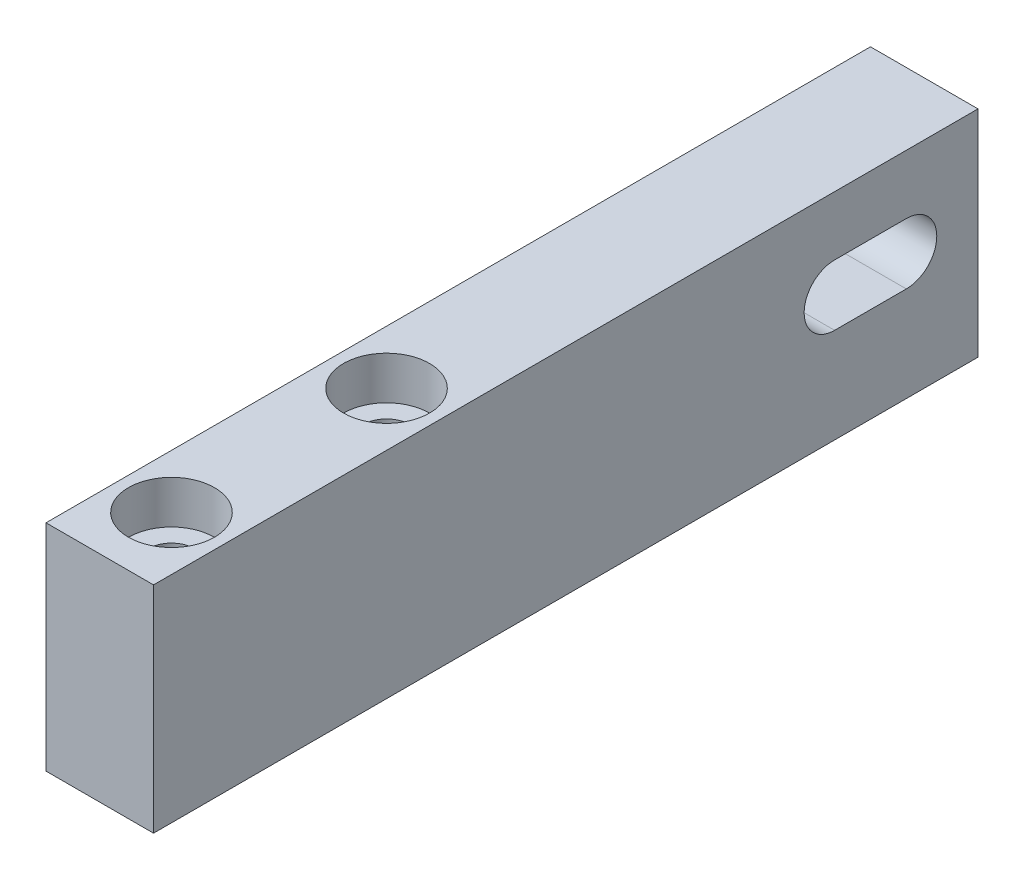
ISO-10303-21;
HEADER;
FILE_DESCRIPTION(('STEP AP214'),'2;1');
FILE_NAME('part.step','',(''),(''),'','','');
FILE_SCHEMA(('AUTOMOTIVE_DESIGN { 1 0 10303 214 1 1 1 1 }'));
ENDSEC;
DATA;
#1=APPLICATION_CONTEXT('core data for automotive mechanical design processes');
#2=APPLICATION_PROTOCOL_DEFINITION('international standard','automotive_design',2000,#1);
#3=PRODUCT_CONTEXT('',#1,'mechanical');
#4=PRODUCT('Part','Part','',(#3));
#5=PRODUCT_RELATED_PRODUCT_CATEGORY('part','',(#4));
#6=PRODUCT_DEFINITION_FORMATION('','',#4);
#7=PRODUCT_DEFINITION_CONTEXT('part definition',#1,'design');
#8=PRODUCT_DEFINITION('design','',#6,#7);
#9=PRODUCT_DEFINITION_SHAPE('','',#8);
#10=(LENGTH_UNIT() NAMED_UNIT(*) SI_UNIT(.MILLI.,.METRE.));
#11=(NAMED_UNIT(*) PLANE_ANGLE_UNIT() SI_UNIT($,.RADIAN.));
#12=(NAMED_UNIT(*) SI_UNIT($,.STERADIAN.) SOLID_ANGLE_UNIT());
#13=UNCERTAINTY_MEASURE_WITH_UNIT(LENGTH_MEASURE(1.E-05),#10,'distance_accuracy_value','');
#14=(GEOMETRIC_REPRESENTATION_CONTEXT(3) GLOBAL_UNCERTAINTY_ASSIGNED_CONTEXT((#13)) GLOBAL_UNIT_ASSIGNED_CONTEXT((#10,
#11,#12)) REPRESENTATION_CONTEXT('',''));
#15=CARTESIAN_POINT('',(0.,0.,0.));
#16=DIRECTION('',(0.,0.,1.));
#17=DIRECTION('',(1.,0.,0.));
#18=AXIS2_PLACEMENT_3D('',#15,#16,#17);
#19=CARTESIAN_POINT('',(-1.11022302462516E-13,-1.11022302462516E-13,-115.));
#20=DIRECTION('',(-1.,0.,0.));
#21=DIRECTION('',(0.,0.,1.));
#22=AXIS2_PLACEMENT_3D('',#19,#20,#21);
#23=PLANE('',#22);
#24=CARTESIAN_POINT('',(0.,17.5,-105.));
#25=DIRECTION('',(-1.,0.,0.));
#26=DIRECTION('',(0.,0.,-1.));
#27=AXIS2_PLACEMENT_3D('',#24,#25,#26);
#28=CIRCLE('',#27,4.25);
#29=CARTESIAN_POINT('',(0.,21.75,-105.));
#30=VERTEX_POINT('',#29);
#31=CARTESIAN_POINT('',(-1.88737914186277E-12,13.25,-105.));
#32=VERTEX_POINT('',#31);
#33=EDGE_CURVE('E55',#30,#32,#28,.T.);
#34=ORIENTED_EDGE('',*,*,#33,.F.);
#35=DIRECTION('',(0.,0.,-1.));
#36=VECTOR('',#35,1.);
#37=CARTESIAN_POINT('',(0.,21.75,-105.));
#38=LINE('',#37,#36);
#39=CARTESIAN_POINT('',(0.,21.7499999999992,-95.));
#40=VERTEX_POINT('',#39);
#41=EDGE_CURVE('E118',#40,#30,#38,.T.);
#42=ORIENTED_EDGE('',*,*,#41,.F.);
#43=CARTESIAN_POINT('',(0.,17.4999999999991,-95.));
#44=DIRECTION('',(-1.,0.,0.));
#45=DIRECTION('',(0.,0.,1.));
#46=AXIS2_PLACEMENT_3D('',#43,#44,#45);
#47=CIRCLE('',#46,4.25);
#48=CARTESIAN_POINT('',(0.,13.2499999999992,-95.0000000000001));
#49=VERTEX_POINT('',#48);
#50=EDGE_CURVE('E138',#49,#40,#47,.T.);
#51=ORIENTED_EDGE('',*,*,#50,.F.);
#52=DIRECTION('',(0.,0.,1.));
#53=VECTOR('',#52,1.);
#54=CARTESIAN_POINT('',(-1.88737914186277E-12,13.25,-105.));
#55=LINE('',#54,#53);
#56=EDGE_CURVE('E129',#32,#49,#55,.T.);
#57=ORIENTED_EDGE('',*,*,#56,.F.);
#58=EDGE_LOOP('',(#34,#42,#51,#57));
#59=FACE_BOUND('',#58,.T.);
#60=DIRECTION('',(0.,-0.999999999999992,0.));
#61=VECTOR('',#60,1.);
#62=CARTESIAN_POINT('',(0.,-9.43689570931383E-13,0.));
#63=LINE('',#62,#61);
#64=CARTESIAN_POINT('',(0.,29.9999999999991,0.));
#65=VERTEX_POINT('',#64);
#66=CARTESIAN_POINT('',(0.,-9.43689570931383E-13,0.));
#67=VERTEX_POINT('',#66);
#68=EDGE_CURVE('E182',#65,#67,#63,.T.);
#69=ORIENTED_EDGE('',*,*,#68,.F.);
#70=DIRECTION('',(0.,0.,1.));
#71=VECTOR('',#70,1.);
#72=CARTESIAN_POINT('',(-1.88737914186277E-12,29.9999999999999,-115.));
#73=LINE('',#72,#71);
#74=CARTESIAN_POINT('',(-1.88737914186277E-12,29.9999999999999,-115.));
#75=VERTEX_POINT('',#74);
#76=EDGE_CURVE('E11',#75,#65,#73,.T.);
#77=ORIENTED_EDGE('',*,*,#76,.F.);
#78=DIRECTION('',(0.,-0.999999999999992,0.));
#79=VECTOR('',#78,1.);
#80=CARTESIAN_POINT('',(-1.11022302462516E-13,-1.11022302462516E-13,-115.));
#81=LINE('',#80,#79);
#82=CARTESIAN_POINT('',(-1.11022302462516E-13,-1.11022302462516E-13,-115.));
#83=VERTEX_POINT('',#82);
#84=EDGE_CURVE('E197',#75,#83,#81,.T.);
#85=ORIENTED_EDGE('',*,*,#84,.T.);
#86=DIRECTION('',(0.,0.,1.));
#87=VECTOR('',#86,1.);
#88=CARTESIAN_POINT('',(-1.11022302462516E-13,-1.11022302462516E-13,-115.));
#89=LINE('',#88,#87);
#90=EDGE_CURVE('E41',#83,#67,#89,.T.);
#91=ORIENTED_EDGE('',*,*,#90,.T.);
#92=EDGE_LOOP('',(#69,#77,#85,#91));
#93=FACE_BOUND('',#92,.T.);
#94=ADVANCED_FACE('F38',(#59,#93),#23,.T.);
#95=CARTESIAN_POINT('',(-1.88737914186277E-12,29.9999999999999,-115.));
#96=DIRECTION('',(0.,0.999999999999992,0.));
#97=DIRECTION('',(0.,0.,1.));
#98=AXIS2_PLACEMENT_3D('',#95,#96,#97);
#99=PLANE('',#98);
#100=CARTESIAN_POINT('',(7.49999999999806,29.9999999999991,-40.));
#101=DIRECTION('',(0.,0.999999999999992,0.));
#102=DIRECTION('',(0.,0.,1.));
#103=AXIS2_PLACEMENT_3D('',#100,#101,#102);
#104=CIRCLE('',#103,5.99999999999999);
#105=CARTESIAN_POINT('',(7.49999999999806,29.9999999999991,-34.));
#106=VERTEX_POINT('',#105);
#107=EDGE_CURVE('E111',#106,#106,#104,.T.);
#108=ORIENTED_EDGE('',*,*,#107,.F.);
#109=EDGE_LOOP('',(#108));
#110=FACE_BOUND('',#109,.T.);
#111=CARTESIAN_POINT('',(7.49999999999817,29.9999999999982,-10.));
#112=DIRECTION('',(0.,0.999999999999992,0.));
#113=DIRECTION('',(0.,0.,1.));
#114=AXIS2_PLACEMENT_3D('',#111,#112,#113);
#115=CIRCLE('',#114,5.99999999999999);
#116=CARTESIAN_POINT('',(7.49999999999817,29.9999999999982,-4.00000000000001));
#117=VERTEX_POINT('',#116);
#118=EDGE_CURVE('E166',#117,#117,#115,.T.);
#119=ORIENTED_EDGE('',*,*,#118,.F.);
#120=EDGE_LOOP('',(#119));
#121=FACE_BOUND('',#120,.T.);
#122=DIRECTION('',(-1.,0.,0.));
#123=VECTOR('',#122,1.);
#124=CARTESIAN_POINT('',(0.,29.9999999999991,0.));
#125=LINE('',#124,#123);
#126=CARTESIAN_POINT('',(15.,29.9999999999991,-3.77475828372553E-12));
#127=VERTEX_POINT('',#126);
#128=EDGE_CURVE('E193',#127,#65,#125,.T.);
#129=ORIENTED_EDGE('',*,*,#128,.F.);
#130=DIRECTION('',(0.,0.,1.));
#131=VECTOR('',#130,1.);
#132=CARTESIAN_POINT('',(14.9999999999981,29.9999999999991,-115.));
#133=LINE('',#132,#131);
#134=CARTESIAN_POINT('',(14.9999999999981,29.9999999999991,-115.));
#135=VERTEX_POINT('',#134);
#136=EDGE_CURVE('E47',#135,#127,#133,.T.);
#137=ORIENTED_EDGE('',*,*,#136,.F.);
#138=DIRECTION('',(-1.,0.,0.));
#139=VECTOR('',#138,1.);
#140=CARTESIAN_POINT('',(-1.88737914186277E-12,29.9999999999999,-115.));
#141=LINE('',#140,#139);
#142=EDGE_CURVE('E209',#135,#75,#141,.T.);
#143=ORIENTED_EDGE('',*,*,#142,.T.);
#144=ORIENTED_EDGE('',*,*,#76,.T.);
#145=EDGE_LOOP('',(#129,#137,#143,#144));
#146=FACE_BOUND('',#145,.T.);
#147=ADVANCED_FACE('F229',(#110,#121,#146),#99,.T.);
#148=CARTESIAN_POINT('',(15.,-8.32667268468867E-13,-115.));
#149=DIRECTION('',(1.,0.,0.));
#150=DIRECTION('',(0.,0.,-1.));
#151=AXIS2_PLACEMENT_3D('',#148,#149,#150);
#152=PLANE('',#151);
#153=CARTESIAN_POINT('',(15.,17.4999999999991,-105.));
#154=DIRECTION('',(1.,0.,0.));
#155=DIRECTION('',(0.,0.,-1.));
#156=AXIS2_PLACEMENT_3D('',#153,#154,#155);
#157=CIRCLE('',#156,4.25);
#158=CARTESIAN_POINT('',(15.,21.749999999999,-105.));
#159=VERTEX_POINT('',#158);
#160=CARTESIAN_POINT('',(14.9999999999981,13.249999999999,-105.));
#161=VERTEX_POINT('',#160);
#162=EDGE_CURVE('E115',#159,#161,#157,.F.);
#163=ORIENTED_EDGE('',*,*,#162,.T.);
#164=DIRECTION('',(0.,0.,1.));
#165=VECTOR('',#164,1.);
#166=CARTESIAN_POINT('',(14.9999999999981,13.249999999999,-105.));
#167=LINE('',#166,#165);
#168=CARTESIAN_POINT('',(15.,13.249999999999,-95.0000000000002));
#169=VERTEX_POINT('',#168);
#170=EDGE_CURVE('E103',#161,#169,#167,.T.);
#171=ORIENTED_EDGE('',*,*,#170,.T.);
#172=CARTESIAN_POINT('',(15.,17.4999999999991,-95.));
#173=DIRECTION('',(1.,0.,0.));
#174=DIRECTION('',(0.,0.,-1.));
#175=AXIS2_PLACEMENT_3D('',#172,#173,#174);
#176=CIRCLE('',#175,4.25);
#177=CARTESIAN_POINT('',(15.,21.749999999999,-95.0000000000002));
#178=VERTEX_POINT('',#177);
#179=EDGE_CURVE('E132',#169,#178,#176,.F.);
#180=ORIENTED_EDGE('',*,*,#179,.T.);
#181=DIRECTION('',(0.,0.,-1.));
#182=VECTOR('',#181,1.);
#183=CARTESIAN_POINT('',(15.,21.749999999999,-105.));
#184=LINE('',#183,#182);
#185=EDGE_CURVE('E123',#178,#159,#184,.T.);
#186=ORIENTED_EDGE('',*,*,#185,.T.);
#187=EDGE_LOOP('',(#163,#171,#180,#186));
#188=FACE_BOUND('',#187,.T.);
#189=DIRECTION('',(0.,0.999999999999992,0.));
#190=VECTOR('',#189,1.);
#191=CARTESIAN_POINT('',(15.,-1.0547118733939E-12,0.));
#192=LINE('',#191,#190);
#193=CARTESIAN_POINT('',(15.,-1.0547118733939E-12,0.));
#194=VERTEX_POINT('',#193);
#195=EDGE_CURVE('E190',#194,#127,#192,.T.);
#196=ORIENTED_EDGE('',*,*,#195,.F.);
#197=DIRECTION('',(0.,0.,1.));
#198=VECTOR('',#197,1.);
#199=CARTESIAN_POINT('',(15.,-8.32667268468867E-13,-115.));
#200=LINE('',#199,#198);
#201=CARTESIAN_POINT('',(15.,-8.32667268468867E-13,-115.));
#202=VERTEX_POINT('',#201);
#203=EDGE_CURVE('E214',#202,#194,#200,.T.);
#204=ORIENTED_EDGE('',*,*,#203,.F.);
#205=DIRECTION('',(0.,0.999999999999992,0.));
#206=VECTOR('',#205,1.);
#207=CARTESIAN_POINT('',(15.,-8.32667268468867E-13,-115.));
#208=LINE('',#207,#206);
#209=EDGE_CURVE('E205',#202,#135,#208,.T.);
#210=ORIENTED_EDGE('',*,*,#209,.T.);
#211=ORIENTED_EDGE('',*,*,#136,.T.);
#212=EDGE_LOOP('',(#196,#204,#210,#211));
#213=FACE_BOUND('',#212,.T.);
#214=ADVANCED_FACE('F121',(#188,#213),#152,.T.);
#215=CARTESIAN_POINT('',(-1.11022302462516E-13,-1.11022302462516E-13,-115.));
#216=DIRECTION('',(0.,-0.999999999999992,0.));
#217=DIRECTION('',(0.,0.,-1.));
#218=AXIS2_PLACEMENT_3D('',#215,#216,#217);
#219=PLANE('',#218);
#220=CARTESIAN_POINT('',(7.49999999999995,-8.32667268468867E-13,-40.));
#221=DIRECTION('',(0.,0.999999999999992,0.));
#222=DIRECTION('',(0.,0.,1.));
#223=AXIS2_PLACEMENT_3D('',#220,#221,#222);
#224=CIRCLE('',#223,3.24999999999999);
#225=CARTESIAN_POINT('',(7.49999999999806,-8.29197821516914E-13,-36.75));
#226=VERTEX_POINT('',#225);
#227=EDGE_CURVE('E162',#226,#226,#224,.T.);
#228=ORIENTED_EDGE('',*,*,#227,.T.);
#229=EDGE_LOOP('',(#228));
#230=FACE_BOUND('',#229,.T.);
#231=CARTESIAN_POINT('',(7.49999999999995,0.,-10.));
#232=DIRECTION('',(0.,0.999999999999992,0.));
#233=DIRECTION('',(0.,0.,1.));
#234=AXIS2_PLACEMENT_3D('',#231,#232,#233);
#235=CIRCLE('',#234,3.24999999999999);
#236=CARTESIAN_POINT('',(7.49999999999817,0.,-6.75000000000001));
#237=VERTEX_POINT('',#236);
#238=EDGE_CURVE('E178',#237,#237,#235,.T.);
#239=ORIENTED_EDGE('',*,*,#238,.T.);
#240=EDGE_LOOP('',(#239));
#241=FACE_BOUND('',#240,.T.);
#242=DIRECTION('',(1.,0.,0.));
#243=VECTOR('',#242,1.);
#244=CARTESIAN_POINT('',(0.,-9.43689570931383E-13,0.));
#245=LINE('',#244,#243);
#246=EDGE_CURVE('E186',#67,#194,#245,.T.);
#247=ORIENTED_EDGE('',*,*,#246,.F.);
#248=ORIENTED_EDGE('',*,*,#90,.F.);
#249=DIRECTION('',(1.,0.,0.));
#250=VECTOR('',#249,1.);
#251=CARTESIAN_POINT('',(-1.11022302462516E-13,-1.11022302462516E-13,-115.));
#252=LINE('',#251,#250);
#253=EDGE_CURVE('E201',#83,#202,#252,.T.);
#254=ORIENTED_EDGE('',*,*,#253,.T.);
#255=ORIENTED_EDGE('',*,*,#203,.T.);
#256=EDGE_LOOP('',(#247,#248,#254,#255));
#257=FACE_BOUND('',#256,.T.);
#258=ADVANCED_FACE('F224',(#230,#241,#257),#219,.T.);
#259=CARTESIAN_POINT('',(-1.88737914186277E-12,29.9999999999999,-115.));
#260=DIRECTION('',(0.,0.,-1.));
#261=DIRECTION('',(-1.,0.,0.));
#262=AXIS2_PLACEMENT_3D('',#259,#260,#261);
#263=PLANE('',#262);
#264=ORIENTED_EDGE('',*,*,#84,.F.);
#265=ORIENTED_EDGE('',*,*,#142,.F.);
#266=ORIENTED_EDGE('',*,*,#209,.F.);
#267=ORIENTED_EDGE('',*,*,#253,.F.);
#268=EDGE_LOOP('',(#264,#265,#266,#267));
#269=FACE_BOUND('',#268,.T.);
#270=ADVANCED_FACE('F232',(#269),#263,.T.);
#271=CARTESIAN_POINT('',(0.,29.9999999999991,0.));
#272=DIRECTION('',(0.,0.,-1.));
#273=DIRECTION('',(-1.,0.,0.));
#274=AXIS2_PLACEMENT_3D('',#271,#272,#273);
#275=PLANE('',#274);
#276=ORIENTED_EDGE('',*,*,#68,.T.);
#277=ORIENTED_EDGE('',*,*,#246,.T.);
#278=ORIENTED_EDGE('',*,*,#195,.T.);
#279=ORIENTED_EDGE('',*,*,#128,.T.);
#280=EDGE_LOOP('',(#276,#277,#278,#279));
#281=FACE_BOUND('',#280,.T.);
#282=ADVANCED_FACE('F226',(#281),#275,.F.);
#283=CARTESIAN_POINT('',(7.49999999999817,29.9999999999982,-10.));
#284=DIRECTION('',(0.,0.999999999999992,0.));
#285=DIRECTION('',(0.,0.,1.));
#286=AXIS2_PLACEMENT_3D('',#283,#284,#285);
#287=CYLINDRICAL_SURFACE('',#286,3.25);
#288=CARTESIAN_POINT('',(7.49999999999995,23.9999999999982,-10.));
#289=DIRECTION('',(0.,0.999999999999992,0.));
#290=DIRECTION('',(0.,0.,1.));
#291=AXIS2_PLACEMENT_3D('',#288,#289,#290);
#292=CIRCLE('',#291,3.25000000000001);
#293=CARTESIAN_POINT('',(7.49999999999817,23.9999999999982,-6.75000000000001));
#294=VERTEX_POINT('',#293);
#295=EDGE_CURVE('E174',#294,#294,#292,.T.);
#296=CARTESIAN_POINT('',(7.49999999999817,0.,-6.75000000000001));
#297=CARTESIAN_POINT('',(7.49999999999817,0.249999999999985,-6.75000000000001));
#298=CARTESIAN_POINT('',(7.49999999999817,0.499999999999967,-6.75000000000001));
#299=CARTESIAN_POINT('',(7.49999999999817,0.999999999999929,-6.75000000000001));
#300=CARTESIAN_POINT('',(7.49999999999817,1.24999999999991,-6.75000000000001));
#301=CARTESIAN_POINT('',(7.49999999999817,1.74999999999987,-6.75000000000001));
#302=CARTESIAN_POINT('',(7.49999999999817,1.99999999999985,-6.75000000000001));
#303=CARTESIAN_POINT('',(7.49999999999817,2.49999999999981,-6.75000000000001));
#304=CARTESIAN_POINT('',(7.49999999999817,2.7499999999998,-6.75000000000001));
#305=CARTESIAN_POINT('',(7.49999999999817,3.24999999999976,-6.75000000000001));
#306=CARTESIAN_POINT('',(7.49999999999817,3.49999999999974,-6.75000000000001));
#307=CARTESIAN_POINT('',(7.49999999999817,3.9999999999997,-6.75000000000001));
#308=CARTESIAN_POINT('',(7.49999999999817,4.24999999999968,-6.75000000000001));
#309=CARTESIAN_POINT('',(7.49999999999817,4.74999999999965,-6.75000000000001));
#310=CARTESIAN_POINT('',(7.49999999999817,4.99999999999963,-6.75000000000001));
#311=CARTESIAN_POINT('',(7.49999999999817,5.49999999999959,-6.75000000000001));
#312=CARTESIAN_POINT('',(7.49999999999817,5.74999999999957,-6.75000000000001));
#313=CARTESIAN_POINT('',(7.49999999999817,6.24999999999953,-6.75000000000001));
#314=CARTESIAN_POINT('',(7.49999999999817,6.49999999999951,-6.75000000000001));
#315=CARTESIAN_POINT('',(7.49999999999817,6.99999999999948,-6.75000000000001));
#316=CARTESIAN_POINT('',(7.49999999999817,7.24999999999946,-6.75000000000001));
#317=CARTESIAN_POINT('',(7.49999999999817,7.74999999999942,-6.75000000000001));
#318=CARTESIAN_POINT('',(7.49999999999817,7.9999999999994,-6.75000000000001));
#319=CARTESIAN_POINT('',(7.49999999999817,8.49999999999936,-6.75000000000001));
#320=CARTESIAN_POINT('',(7.49999999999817,8.74999999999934,-6.75000000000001));
#321=CARTESIAN_POINT('',(7.49999999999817,9.24999999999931,-6.75000000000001));
#322=CARTESIAN_POINT('',(7.49999999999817,9.49999999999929,-6.75000000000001));
#323=CARTESIAN_POINT('',(7.49999999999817,9.99999999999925,-6.75000000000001));
#324=CARTESIAN_POINT('',(7.49999999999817,10.2499999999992,-6.75000000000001));
#325=CARTESIAN_POINT('',(7.49999999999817,10.7499999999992,-6.75000000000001));
#326=CARTESIAN_POINT('',(7.49999999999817,10.9999999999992,-6.75000000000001));
#327=CARTESIAN_POINT('',(7.49999999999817,11.4999999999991,-6.75000000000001));
#328=CARTESIAN_POINT('',(7.49999999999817,11.7499999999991,-6.75000000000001));
#329=CARTESIAN_POINT('',(7.49999999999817,12.2499999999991,-6.75000000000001));
#330=CARTESIAN_POINT('',(7.49999999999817,12.4999999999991,-6.75000000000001));
#331=CARTESIAN_POINT('',(7.49999999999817,12.999999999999,-6.75000000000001));
#332=CARTESIAN_POINT('',(7.49999999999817,13.249999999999,-6.75000000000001));
#333=CARTESIAN_POINT('',(7.49999999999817,13.749999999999,-6.75000000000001));
#334=CARTESIAN_POINT('',(7.49999999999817,13.9999999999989,-6.75000000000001));
#335=CARTESIAN_POINT('',(7.49999999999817,14.4999999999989,-6.75000000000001));
#336=CARTESIAN_POINT('',(7.49999999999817,14.7499999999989,-6.75000000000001));
#337=CARTESIAN_POINT('',(7.49999999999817,15.2499999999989,-6.75000000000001));
#338=CARTESIAN_POINT('',(7.49999999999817,15.4999999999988,-6.75000000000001));
#339=CARTESIAN_POINT('',(7.49999999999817,15.9999999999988,-6.75000000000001));
#340=CARTESIAN_POINT('',(7.49999999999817,16.2499999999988,-6.75000000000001));
#341=CARTESIAN_POINT('',(7.49999999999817,16.7499999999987,-6.75000000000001));
#342=CARTESIAN_POINT('',(7.49999999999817,16.9999999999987,-6.75000000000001));
#343=CARTESIAN_POINT('',(7.49999999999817,17.4999999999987,-6.75000000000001));
#344=CARTESIAN_POINT('',(7.49999999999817,17.7499999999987,-6.75000000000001));
#345=CARTESIAN_POINT('',(7.49999999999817,18.2499999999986,-6.75000000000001));
#346=CARTESIAN_POINT('',(7.49999999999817,18.4999999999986,-6.75000000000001));
#347=CARTESIAN_POINT('',(7.49999999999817,18.9999999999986,-6.75000000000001));
#348=CARTESIAN_POINT('',(7.49999999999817,19.2499999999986,-6.75000000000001));
#349=CARTESIAN_POINT('',(7.49999999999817,19.7499999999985,-6.75000000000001));
#350=CARTESIAN_POINT('',(7.49999999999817,19.9999999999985,-6.75000000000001));
#351=CARTESIAN_POINT('',(7.49999999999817,20.4999999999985,-6.75000000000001));
#352=CARTESIAN_POINT('',(7.49999999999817,20.7499999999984,-6.75000000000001));
#353=CARTESIAN_POINT('',(7.49999999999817,21.2499999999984,-6.75000000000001));
#354=CARTESIAN_POINT('',(7.49999999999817,21.4999999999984,-6.75000000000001));
#355=CARTESIAN_POINT('',(7.49999999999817,21.9999999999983,-6.75000000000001));
#356=CARTESIAN_POINT('',(7.49999999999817,22.2499999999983,-6.75000000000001));
#357=CARTESIAN_POINT('',(7.49999999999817,22.7499999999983,-6.75000000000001));
#358=CARTESIAN_POINT('',(7.49999999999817,22.9999999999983,-6.75000000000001));
#359=CARTESIAN_POINT('',(7.49999999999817,23.4999999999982,-6.75000000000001));
#360=CARTESIAN_POINT('',(7.49999999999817,23.7499999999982,-6.75000000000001));
#361=CARTESIAN_POINT('',(7.49999999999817,23.9999999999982,-6.75000000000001));
#362=B_SPLINE_CURVE_WITH_KNOTS('',3,(#296,#297,#298,#299,#300,#301,#302,#303,#304,#305,#306,
#307,#308,#309,#310,#311,#312,#313,#314,#315,#316,#317,#318,#319,#320,#321,#322,#323,#324,#325,
#326,#327,#328,#329,#330,#331,#332,#333,#334,#335,#336,#337,#338,#339,#340,#341,#342,#343,#344,
#345,#346,#347,#348,#349,#350,#351,#352,#353,#354,#355,#356,#357,#358,#359,#360,#361),
.UNSPECIFIED.,.F.,.F.,(4,2,2,2,2,2,2,2,2,2,2,2,2,2,2,2,2,2,2,2,2,2,2,2,2,2,2,2,2,2,2,2,4),(0.,
0.749999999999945,1.49999999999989,2.24999999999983,2.99999999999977,3.74999999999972,
4.49999999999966,5.24999999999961,5.99999999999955,6.74999999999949,7.49999999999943,
8.24999999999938,8.99999999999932,9.74999999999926,10.4999999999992,11.2499999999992,
11.9999999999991,12.749999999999,13.499999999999,14.2499999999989,14.9999999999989,
15.7499999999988,16.4999999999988,17.2499999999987,17.9999999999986,18.7499999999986,
19.4999999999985,20.2499999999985,20.9999999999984,21.7499999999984,22.4999999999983,
23.2499999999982,23.9999999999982),.UNSPECIFIED.);
#363=EDGE_CURVE('BSEAM285',#237,#294,#362,.T.);
#364=ORIENTED_EDGE('',*,*,#238,.F.);
#365=ORIENTED_EDGE('',*,*,#295,.T.);
#366=ORIENTED_EDGE('',*,*,#363,.T.);
#367=ORIENTED_EDGE('',*,*,#363,.F.);
#368=EDGE_LOOP('',(#364,#366,#365,#367));
#369=FACE_BOUND('',#368,.T.);
#370=ADVANCED_FACE('F285',(#369),#287,.F.);
#371=CARTESIAN_POINT('',(10.7499999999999,23.9999999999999,-10.0000000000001));
#372=DIRECTION('',(0.,-0.999999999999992,0.));
#373=DIRECTION('',(0.,0.,-1.));
#374=AXIS2_PLACEMENT_3D('',#371,#372,#373);
#375=PLANE('',#374);
#376=ORIENTED_EDGE('',*,*,#295,.F.);
#377=EDGE_LOOP('',(#376));
#378=FACE_BOUND('',#377,.T.);
#379=CARTESIAN_POINT('',(7.49999999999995,23.9999999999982,-10.));
#380=DIRECTION('',(0.,0.999999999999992,0.));
#381=DIRECTION('',(0.,0.,1.));
#382=AXIS2_PLACEMENT_3D('',#379,#380,#381);
#383=CIRCLE('',#382,6.);
#384=CARTESIAN_POINT('',(7.49999999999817,23.9999999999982,-4.00000000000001));
#385=VERTEX_POINT('',#384);
#386=EDGE_CURVE('E170',#385,#385,#383,.T.);
#387=ORIENTED_EDGE('',*,*,#386,.T.);
#388=EDGE_LOOP('',(#387));
#389=FACE_BOUND('',#388,.T.);
#390=ADVANCED_FACE('F281',(#378,#389),#375,.F.);
#391=CARTESIAN_POINT('',(7.49999999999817,29.9999999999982,-10.));
#392=DIRECTION('',(0.,0.999999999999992,0.));
#393=DIRECTION('',(0.,0.,1.));
#394=AXIS2_PLACEMENT_3D('',#391,#392,#393);
#395=CYLINDRICAL_SURFACE('',#394,6.);
#396=CARTESIAN_POINT('',(7.49999999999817,23.9999999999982,-4.00000000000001));
#397=CARTESIAN_POINT('',(7.49999999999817,24.0624999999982,-4.00000000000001));
#398=CARTESIAN_POINT('',(7.49999999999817,24.1249999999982,-4.00000000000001));
#399=CARTESIAN_POINT('',(7.49999999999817,24.2499999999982,-4.00000000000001));
#400=CARTESIAN_POINT('',(7.49999999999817,24.3124999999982,-4.00000000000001));
#401=CARTESIAN_POINT('',(7.49999999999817,24.4374999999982,-4.00000000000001));
#402=CARTESIAN_POINT('',(7.49999999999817,24.4999999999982,-4.00000000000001));
#403=CARTESIAN_POINT('',(7.49999999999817,24.6249999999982,-4.00000000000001));
#404=CARTESIAN_POINT('',(7.49999999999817,24.6874999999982,-4.00000000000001));
#405=CARTESIAN_POINT('',(7.49999999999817,24.8124999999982,-4.00000000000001));
#406=CARTESIAN_POINT('',(7.49999999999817,24.8749999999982,-4.00000000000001));
#407=CARTESIAN_POINT('',(7.49999999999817,24.9999999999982,-4.00000000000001));
#408=CARTESIAN_POINT('',(7.49999999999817,25.0624999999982,-4.00000000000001));
#409=CARTESIAN_POINT('',(7.49999999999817,25.1874999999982,-4.00000000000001));
#410=CARTESIAN_POINT('',(7.49999999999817,25.2499999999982,-4.00000000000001));
#411=CARTESIAN_POINT('',(7.49999999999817,25.3749999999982,-4.00000000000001));
#412=CARTESIAN_POINT('',(7.49999999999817,25.4374999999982,-4.00000000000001));
#413=CARTESIAN_POINT('',(7.49999999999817,25.5624999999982,-4.00000000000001));
#414=CARTESIAN_POINT('',(7.49999999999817,25.6249999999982,-4.00000000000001));
#415=CARTESIAN_POINT('',(7.49999999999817,25.7499999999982,-4.00000000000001));
#416=CARTESIAN_POINT('',(7.49999999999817,25.8124999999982,-4.00000000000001));
#417=CARTESIAN_POINT('',(7.49999999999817,25.9374999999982,-4.00000000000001));
#418=CARTESIAN_POINT('',(7.49999999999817,25.9999999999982,-4.00000000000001));
#419=CARTESIAN_POINT('',(7.49999999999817,26.1249999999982,-4.00000000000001));
#420=CARTESIAN_POINT('',(7.49999999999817,26.1874999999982,-4.00000000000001));
#421=CARTESIAN_POINT('',(7.49999999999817,26.3124999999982,-4.00000000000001));
#422=CARTESIAN_POINT('',(7.49999999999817,26.3749999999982,-4.00000000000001));
#423=CARTESIAN_POINT('',(7.49999999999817,26.4999999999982,-4.00000000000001));
#424=CARTESIAN_POINT('',(7.49999999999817,26.5624999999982,-4.00000000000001));
#425=CARTESIAN_POINT('',(7.49999999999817,26.6874999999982,-4.00000000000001));
#426=CARTESIAN_POINT('',(7.49999999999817,26.7499999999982,-4.00000000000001));
#427=CARTESIAN_POINT('',(7.49999999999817,26.8749999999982,-4.00000000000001));
#428=CARTESIAN_POINT('',(7.49999999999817,26.9374999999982,-4.00000000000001));
#429=CARTESIAN_POINT('',(7.49999999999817,27.0624999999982,-4.00000000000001));
#430=CARTESIAN_POINT('',(7.49999999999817,27.1249999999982,-4.00000000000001));
#431=CARTESIAN_POINT('',(7.49999999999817,27.2499999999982,-4.00000000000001));
#432=CARTESIAN_POINT('',(7.49999999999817,27.3124999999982,-4.00000000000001));
#433=CARTESIAN_POINT('',(7.49999999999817,27.4374999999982,-4.00000000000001));
#434=CARTESIAN_POINT('',(7.49999999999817,27.4999999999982,-4.00000000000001));
#435=CARTESIAN_POINT('',(7.49999999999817,27.6249999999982,-4.00000000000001));
#436=CARTESIAN_POINT('',(7.49999999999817,27.6874999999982,-4.00000000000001));
#437=CARTESIAN_POINT('',(7.49999999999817,27.8124999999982,-4.00000000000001));
#438=CARTESIAN_POINT('',(7.49999999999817,27.8749999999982,-4.00000000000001));
#439=CARTESIAN_POINT('',(7.49999999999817,27.9999999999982,-4.00000000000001));
#440=CARTESIAN_POINT('',(7.49999999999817,28.0624999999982,-4.00000000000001));
#441=CARTESIAN_POINT('',(7.49999999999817,28.1874999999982,-4.00000000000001));
#442=CARTESIAN_POINT('',(7.49999999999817,28.2499999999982,-4.00000000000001));
#443=CARTESIAN_POINT('',(7.49999999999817,28.3749999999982,-4.00000000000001));
#444=CARTESIAN_POINT('',(7.49999999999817,28.4374999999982,-4.00000000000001));
#445=CARTESIAN_POINT('',(7.49999999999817,28.5624999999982,-4.00000000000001));
#446=CARTESIAN_POINT('',(7.49999999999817,28.6249999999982,-4.00000000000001));
#447=CARTESIAN_POINT('',(7.49999999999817,28.7499999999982,-4.00000000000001));
#448=CARTESIAN_POINT('',(7.49999999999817,28.8124999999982,-4.00000000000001));
#449=CARTESIAN_POINT('',(7.49999999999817,28.9374999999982,-4.00000000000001));
#450=CARTESIAN_POINT('',(7.49999999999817,28.9999999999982,-4.00000000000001));
#451=CARTESIAN_POINT('',(7.49999999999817,29.1249999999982,-4.00000000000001));
#452=CARTESIAN_POINT('',(7.49999999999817,29.1874999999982,-4.00000000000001));
#453=CARTESIAN_POINT('',(7.49999999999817,29.3124999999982,-4.00000000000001));
#454=CARTESIAN_POINT('',(7.49999999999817,29.3749999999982,-4.00000000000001));
#455=CARTESIAN_POINT('',(7.49999999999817,29.4999999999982,-4.00000000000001));
#456=CARTESIAN_POINT('',(7.49999999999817,29.5624999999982,-4.00000000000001));
#457=CARTESIAN_POINT('',(7.49999999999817,29.6874999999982,-4.00000000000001));
#458=CARTESIAN_POINT('',(7.49999999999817,29.7499999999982,-4.00000000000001));
#459=CARTESIAN_POINT('',(7.49999999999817,29.8749999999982,-4.00000000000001));
#460=CARTESIAN_POINT('',(7.49999999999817,29.9374999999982,-4.00000000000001));
#461=CARTESIAN_POINT('',(7.49999999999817,29.9999999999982,-4.00000000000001));
#462=B_SPLINE_CURVE_WITH_KNOTS('',3,(#396,#397,#398,#399,#400,#401,#402,#403,#404,#405,#406,
#407,#408,#409,#410,#411,#412,#413,#414,#415,#416,#417,#418,#419,#420,#421,#422,#423,#424,#425,
#426,#427,#428,#429,#430,#431,#432,#433,#434,#435,#436,#437,#438,#439,#440,#441,#442,#443,#444,
#445,#446,#447,#448,#449,#450,#451,#452,#453,#454,#455,#456,#457,#458,#459,#460,#461),
.UNSPECIFIED.,.F.,.F.,(4,2,2,2,2,2,2,2,2,2,2,2,2,2,2,2,2,2,2,2,2,2,2,2,2,2,2,2,2,2,2,2,4),(0.,
0.187500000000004,0.375,0.5625,0.750000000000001,0.937500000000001,1.125,1.3125,1.5,1.6875,
1.875,2.0625,2.25,2.4375,2.62500000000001,2.8125,3.,3.1875,3.375,3.5625,3.75,3.9375,
4.12500000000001,4.3125,4.5,4.68750000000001,4.875,5.06250000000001,5.25000000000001,5.4375,
5.62500000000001,5.81250000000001,6.00000000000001),.UNSPECIFIED.);
#463=EDGE_CURVE('BSEAM277',#385,#117,#462,.T.);
#464=ORIENTED_EDGE('',*,*,#386,.F.);
#465=ORIENTED_EDGE('',*,*,#118,.T.);
#466=ORIENTED_EDGE('',*,*,#463,.T.);
#467=ORIENTED_EDGE('',*,*,#463,.F.);
#468=EDGE_LOOP('',(#464,#466,#465,#467));
#469=FACE_BOUND('',#468,.T.);
#470=ADVANCED_FACE('F277',(#469),#395,.F.);
#471=CARTESIAN_POINT('',(7.49999999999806,29.9999999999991,-40.));
#472=DIRECTION('',(0.,0.999999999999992,0.));
#473=DIRECTION('',(0.,0.,1.));
#474=AXIS2_PLACEMENT_3D('',#471,#472,#473);
#475=CYLINDRICAL_SURFACE('',#474,3.25);
#476=CARTESIAN_POINT('',(7.49999999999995,23.9999999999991,-40.));
#477=DIRECTION('',(0.,0.999999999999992,0.));
#478=DIRECTION('',(0.,0.,1.));
#479=AXIS2_PLACEMENT_3D('',#476,#477,#478);
#480=CIRCLE('',#479,3.25000000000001);
#481=CARTESIAN_POINT('',(7.49999999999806,23.9999999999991,-36.75));
#482=VERTEX_POINT('',#481);
#483=EDGE_CURVE('E158',#482,#482,#480,.T.);
#484=CARTESIAN_POINT('',(7.49999999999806,-8.29197821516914E-13,-36.75));
#485=CARTESIAN_POINT('',(7.49999999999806,0.249999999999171,-36.75));
#486=CARTESIAN_POINT('',(7.49999999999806,0.499999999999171,-36.75));
#487=CARTESIAN_POINT('',(7.49999999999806,0.99999999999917,-36.75));
#488=CARTESIAN_POINT('',(7.49999999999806,1.24999999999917,-36.75));
#489=CARTESIAN_POINT('',(7.49999999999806,1.74999999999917,-36.75));
#490=CARTESIAN_POINT('',(7.49999999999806,1.99999999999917,-36.75));
#491=CARTESIAN_POINT('',(7.49999999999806,2.49999999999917,-36.75));
#492=CARTESIAN_POINT('',(7.49999999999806,2.74999999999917,-36.75));
#493=CARTESIAN_POINT('',(7.49999999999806,3.24999999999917,-36.75));
#494=CARTESIAN_POINT('',(7.49999999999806,3.49999999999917,-36.75));
#495=CARTESIAN_POINT('',(7.49999999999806,3.99999999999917,-36.75));
#496=CARTESIAN_POINT('',(7.49999999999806,4.24999999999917,-36.75));
#497=CARTESIAN_POINT('',(7.49999999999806,4.74999999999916,-36.75));
#498=CARTESIAN_POINT('',(7.49999999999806,4.99999999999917,-36.75));
#499=CARTESIAN_POINT('',(7.49999999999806,5.49999999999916,-36.75));
#500=CARTESIAN_POINT('',(7.49999999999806,5.74999999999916,-36.75));
#501=CARTESIAN_POINT('',(7.49999999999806,6.24999999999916,-36.75));
#502=CARTESIAN_POINT('',(7.49999999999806,6.49999999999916,-36.75));
#503=CARTESIAN_POINT('',(7.49999999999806,6.99999999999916,-36.75));
#504=CARTESIAN_POINT('',(7.49999999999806,7.24999999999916,-36.75));
#505=CARTESIAN_POINT('',(7.49999999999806,7.74999999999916,-36.75));
#506=CARTESIAN_POINT('',(7.49999999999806,7.99999999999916,-36.75));
#507=CARTESIAN_POINT('',(7.49999999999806,8.49999999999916,-36.75));
#508=CARTESIAN_POINT('',(7.49999999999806,8.74999999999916,-36.75));
#509=CARTESIAN_POINT('',(7.49999999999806,9.24999999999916,-36.75));
#510=CARTESIAN_POINT('',(7.49999999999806,9.49999999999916,-36.75));
#511=CARTESIAN_POINT('',(7.49999999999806,9.99999999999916,-36.75));
#512=CARTESIAN_POINT('',(7.49999999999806,10.2499999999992,-36.75));
#513=CARTESIAN_POINT('',(7.49999999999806,10.7499999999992,-36.75));
#514=CARTESIAN_POINT('',(7.49999999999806,10.9999999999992,-36.75));
#515=CARTESIAN_POINT('',(7.49999999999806,11.4999999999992,-36.75));
#516=CARTESIAN_POINT('',(7.49999999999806,11.7499999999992,-36.75));
#517=CARTESIAN_POINT('',(7.49999999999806,12.2499999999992,-36.75));
#518=CARTESIAN_POINT('',(7.49999999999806,12.4999999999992,-36.75));
#519=CARTESIAN_POINT('',(7.49999999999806,12.9999999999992,-36.75));
#520=CARTESIAN_POINT('',(7.49999999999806,13.2499999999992,-36.75));
#521=CARTESIAN_POINT('',(7.49999999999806,13.7499999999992,-36.75));
#522=CARTESIAN_POINT('',(7.49999999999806,13.9999999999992,-36.75));
#523=CARTESIAN_POINT('',(7.49999999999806,14.4999999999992,-36.75));
#524=CARTESIAN_POINT('',(7.49999999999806,14.7499999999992,-36.75));
#525=CARTESIAN_POINT('',(7.49999999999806,15.2499999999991,-36.75));
#526=CARTESIAN_POINT('',(7.49999999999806,15.4999999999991,-36.75));
#527=CARTESIAN_POINT('',(7.49999999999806,15.9999999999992,-36.75));
#528=CARTESIAN_POINT('',(7.49999999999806,16.2499999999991,-36.75));
#529=CARTESIAN_POINT('',(7.49999999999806,16.7499999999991,-36.75));
#530=CARTESIAN_POINT('',(7.49999999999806,16.9999999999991,-36.75));
#531=CARTESIAN_POINT('',(7.49999999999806,17.4999999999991,-36.75));
#532=CARTESIAN_POINT('',(7.49999999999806,17.7499999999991,-36.75));
#533=CARTESIAN_POINT('',(7.49999999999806,18.2499999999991,-36.75));
#534=CARTESIAN_POINT('',(7.49999999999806,18.4999999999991,-36.75));
#535=CARTESIAN_POINT('',(7.49999999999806,18.9999999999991,-36.75));
#536=CARTESIAN_POINT('',(7.49999999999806,19.2499999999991,-36.75));
#537=CARTESIAN_POINT('',(7.49999999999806,19.7499999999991,-36.75));
#538=CARTESIAN_POINT('',(7.49999999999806,19.9999999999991,-36.75));
#539=CARTESIAN_POINT('',(7.49999999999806,20.4999999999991,-36.75));
#540=CARTESIAN_POINT('',(7.49999999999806,20.7499999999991,-36.75));
#541=CARTESIAN_POINT('',(7.49999999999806,21.2499999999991,-36.75));
#542=CARTESIAN_POINT('',(7.49999999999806,21.4999999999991,-36.75));
#543=CARTESIAN_POINT('',(7.49999999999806,21.9999999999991,-36.75));
#544=CARTESIAN_POINT('',(7.49999999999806,22.2499999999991,-36.75));
#545=CARTESIAN_POINT('',(7.49999999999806,22.7499999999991,-36.75));
#546=CARTESIAN_POINT('',(7.49999999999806,22.9999999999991,-36.75));
#547=CARTESIAN_POINT('',(7.49999999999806,23.4999999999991,-36.75));
#548=CARTESIAN_POINT('',(7.49999999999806,23.7499999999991,-36.75));
#549=CARTESIAN_POINT('',(7.49999999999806,23.9999999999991,-36.75));
#550=B_SPLINE_CURVE_WITH_KNOTS('',3,(#484,#485,#486,#487,#488,#489,#490,#491,#492,#493,#494,
#495,#496,#497,#498,#499,#500,#501,#502,#503,#504,#505,#506,#507,#508,#509,#510,#511,#512,#513,
#514,#515,#516,#517,#518,#519,#520,#521,#522,#523,#524,#525,#526,#527,#528,#529,#530,#531,#532,
#533,#534,#535,#536,#537,#538,#539,#540,#541,#542,#543,#544,#545,#546,#547,#548,#549),
.UNSPECIFIED.,.F.,.F.,(4,2,2,2,2,2,2,2,2,2,2,2,2,2,2,2,2,2,2,2,2,2,2,2,2,2,2,2,2,2,2,2,4),(0.,
0.750000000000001,1.5,2.25,3.,3.75,4.49999999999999,5.24999999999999,5.99999999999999,
6.74999999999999,7.49999999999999,8.24999999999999,8.99999999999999,9.74999999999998,10.5,11.25,
12.,12.75,13.5,14.25,15.,15.75,16.5,17.25,18.,18.75,19.5,20.25,21.,21.75,22.5,23.25,24.),.UNSPECIFIED.);
#551=EDGE_CURVE('BSEAM273',#226,#482,#550,.T.);
#552=ORIENTED_EDGE('',*,*,#227,.F.);
#553=ORIENTED_EDGE('',*,*,#483,.T.);
#554=ORIENTED_EDGE('',*,*,#551,.T.);
#555=ORIENTED_EDGE('',*,*,#551,.F.);
#556=EDGE_LOOP('',(#552,#554,#553,#555));
#557=FACE_BOUND('',#556,.T.);
#558=ADVANCED_FACE('F273',(#557),#475,.F.);
#559=CARTESIAN_POINT('',(10.7499999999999,23.9999999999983,-40.));
#560=DIRECTION('',(0.,-0.999999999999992,0.));
#561=DIRECTION('',(0.,0.,-1.));
#562=AXIS2_PLACEMENT_3D('',#559,#560,#561);
#563=PLANE('',#562);
#564=ORIENTED_EDGE('',*,*,#483,.F.);
#565=EDGE_LOOP('',(#564));
#566=FACE_BOUND('',#565,.T.);
#567=CARTESIAN_POINT('',(7.49999999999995,23.9999999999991,-40.));
#568=DIRECTION('',(0.,0.999999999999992,0.));
#569=DIRECTION('',(0.,0.,1.));
#570=AXIS2_PLACEMENT_3D('',#567,#568,#569);
#571=CIRCLE('',#570,6.);
#572=CARTESIAN_POINT('',(7.49999999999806,23.9999999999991,-34.));
#573=VERTEX_POINT('',#572);
#574=EDGE_CURVE('E155',#573,#573,#571,.T.);
#575=ORIENTED_EDGE('',*,*,#574,.T.);
#576=EDGE_LOOP('',(#575));
#577=FACE_BOUND('',#576,.T.);
#578=ADVANCED_FACE('F269',(#566,#577),#563,.F.);
#579=CARTESIAN_POINT('',(7.49999999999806,29.9999999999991,-40.));
#580=DIRECTION('',(0.,0.999999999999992,0.));
#581=DIRECTION('',(0.,0.,1.));
#582=AXIS2_PLACEMENT_3D('',#579,#580,#581);
#583=CYLINDRICAL_SURFACE('',#582,6.);
#584=CARTESIAN_POINT('',(7.49999999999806,23.9999999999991,-34.));
#585=CARTESIAN_POINT('',(7.49999999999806,24.0624999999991,-34.));
#586=CARTESIAN_POINT('',(7.49999999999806,24.1249999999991,-34.));
#587=CARTESIAN_POINT('',(7.49999999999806,24.2499999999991,-34.));
#588=CARTESIAN_POINT('',(7.49999999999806,24.3124999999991,-34.));
#589=CARTESIAN_POINT('',(7.49999999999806,24.4374999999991,-34.));
#590=CARTESIAN_POINT('',(7.49999999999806,24.4999999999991,-34.));
#591=CARTESIAN_POINT('',(7.49999999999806,24.6249999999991,-34.));
#592=CARTESIAN_POINT('',(7.49999999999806,24.6874999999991,-34.));
#593=CARTESIAN_POINT('',(7.49999999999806,24.8124999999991,-34.));
#594=CARTESIAN_POINT('',(7.49999999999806,24.8749999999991,-34.));
#595=CARTESIAN_POINT('',(7.49999999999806,24.9999999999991,-34.));
#596=CARTESIAN_POINT('',(7.49999999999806,25.0624999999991,-34.));
#597=CARTESIAN_POINT('',(7.49999999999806,25.1874999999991,-34.));
#598=CARTESIAN_POINT('',(7.49999999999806,25.2499999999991,-34.));
#599=CARTESIAN_POINT('',(7.49999999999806,25.3749999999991,-34.));
#600=CARTESIAN_POINT('',(7.49999999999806,25.4374999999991,-34.));
#601=CARTESIAN_POINT('',(7.49999999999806,25.5624999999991,-34.));
#602=CARTESIAN_POINT('',(7.49999999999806,25.6249999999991,-34.));
#603=CARTESIAN_POINT('',(7.49999999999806,25.7499999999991,-34.));
#604=CARTESIAN_POINT('',(7.49999999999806,25.8124999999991,-34.));
#605=CARTESIAN_POINT('',(7.49999999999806,25.9374999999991,-34.));
#606=CARTESIAN_POINT('',(7.49999999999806,25.9999999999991,-34.));
#607=CARTESIAN_POINT('',(7.49999999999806,26.1249999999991,-34.));
#608=CARTESIAN_POINT('',(7.49999999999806,26.1874999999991,-34.));
#609=CARTESIAN_POINT('',(7.49999999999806,26.3124999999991,-34.));
#610=CARTESIAN_POINT('',(7.49999999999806,26.3749999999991,-34.));
#611=CARTESIAN_POINT('',(7.49999999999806,26.4999999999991,-34.));
#612=CARTESIAN_POINT('',(7.49999999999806,26.5624999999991,-34.));
#613=CARTESIAN_POINT('',(7.49999999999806,26.6874999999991,-34.));
#614=CARTESIAN_POINT('',(7.49999999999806,26.7499999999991,-34.));
#615=CARTESIAN_POINT('',(7.49999999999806,26.8749999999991,-34.));
#616=CARTESIAN_POINT('',(7.49999999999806,26.9374999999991,-34.));
#617=CARTESIAN_POINT('',(7.49999999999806,27.0624999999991,-34.));
#618=CARTESIAN_POINT('',(7.49999999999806,27.1249999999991,-34.));
#619=CARTESIAN_POINT('',(7.49999999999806,27.2499999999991,-34.));
#620=CARTESIAN_POINT('',(7.49999999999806,27.3124999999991,-34.));
#621=CARTESIAN_POINT('',(7.49999999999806,27.4374999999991,-34.));
#622=CARTESIAN_POINT('',(7.49999999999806,27.4999999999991,-34.));
#623=CARTESIAN_POINT('',(7.49999999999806,27.6249999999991,-34.));
#624=CARTESIAN_POINT('',(7.49999999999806,27.6874999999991,-34.));
#625=CARTESIAN_POINT('',(7.49999999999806,27.8124999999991,-34.));
#626=CARTESIAN_POINT('',(7.49999999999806,27.8749999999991,-34.));
#627=CARTESIAN_POINT('',(7.49999999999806,27.9999999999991,-34.));
#628=CARTESIAN_POINT('',(7.49999999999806,28.0624999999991,-34.));
#629=CARTESIAN_POINT('',(7.49999999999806,28.1874999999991,-34.));
#630=CARTESIAN_POINT('',(7.49999999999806,28.2499999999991,-34.));
#631=CARTESIAN_POINT('',(7.49999999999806,28.3749999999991,-34.));
#632=CARTESIAN_POINT('',(7.49999999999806,28.4374999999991,-34.));
#633=CARTESIAN_POINT('',(7.49999999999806,28.5624999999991,-34.));
#634=CARTESIAN_POINT('',(7.49999999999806,28.6249999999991,-34.));
#635=CARTESIAN_POINT('',(7.49999999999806,28.7499999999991,-34.));
#636=CARTESIAN_POINT('',(7.49999999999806,28.8124999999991,-34.));
#637=CARTESIAN_POINT('',(7.49999999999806,28.9374999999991,-34.));
#638=CARTESIAN_POINT('',(7.49999999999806,28.9999999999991,-34.));
#639=CARTESIAN_POINT('',(7.49999999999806,29.1249999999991,-34.));
#640=CARTESIAN_POINT('',(7.49999999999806,29.1874999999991,-34.));
#641=CARTESIAN_POINT('',(7.49999999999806,29.3124999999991,-34.));
#642=CARTESIAN_POINT('',(7.49999999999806,29.3749999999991,-34.));
#643=CARTESIAN_POINT('',(7.49999999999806,29.4999999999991,-34.));
#644=CARTESIAN_POINT('',(7.49999999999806,29.5624999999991,-34.));
#645=CARTESIAN_POINT('',(7.49999999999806,29.6874999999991,-34.));
#646=CARTESIAN_POINT('',(7.49999999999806,29.7499999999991,-34.));
#647=CARTESIAN_POINT('',(7.49999999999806,29.8749999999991,-34.));
#648=CARTESIAN_POINT('',(7.49999999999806,29.9374999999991,-34.));
#649=CARTESIAN_POINT('',(7.49999999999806,29.9999999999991,-34.));
#650=B_SPLINE_CURVE_WITH_KNOTS('',3,(#584,#585,#586,#587,#588,#589,#590,#591,#592,#593,#594,
#595,#596,#597,#598,#599,#600,#601,#602,#603,#604,#605,#606,#607,#608,#609,#610,#611,#612,#613,
#614,#615,#616,#617,#618,#619,#620,#621,#622,#623,#624,#625,#626,#627,#628,#629,#630,#631,#632,
#633,#634,#635,#636,#637,#638,#639,#640,#641,#642,#643,#644,#645,#646,#647,#648,#649),
.UNSPECIFIED.,.F.,.F.,(4,2,2,2,2,2,2,2,2,2,2,2,2,2,2,2,2,2,2,2,2,2,2,2,2,2,2,2,2,2,2,2,4),(0.,
0.187500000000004,0.375,0.5625,0.750000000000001,0.937500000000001,1.125,1.3125,1.5,1.6875,
1.875,2.0625,2.25,2.4375,2.62500000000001,2.8125,3.,3.1875,3.375,3.5625,3.75,3.9375,
4.12500000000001,4.3125,4.5,4.68750000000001,4.875,5.06250000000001,5.25000000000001,5.4375,
5.62500000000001,5.81250000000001,6.00000000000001),.UNSPECIFIED.);
#651=EDGE_CURVE('BSEAM262',#573,#106,#650,.T.);
#652=ORIENTED_EDGE('',*,*,#574,.F.);
#653=ORIENTED_EDGE('',*,*,#107,.T.);
#654=ORIENTED_EDGE('',*,*,#651,.T.);
#655=ORIENTED_EDGE('',*,*,#651,.F.);
#656=EDGE_LOOP('',(#652,#654,#653,#655));
#657=FACE_BOUND('',#656,.T.);
#658=ADVANCED_FACE('F262',(#657),#583,.F.);
#659=CARTESIAN_POINT('',(15.001,17.4999999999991,-105.));
#660=DIRECTION('',(-1.,0.,0.));
#661=DIRECTION('',(0.,0.,1.));
#662=AXIS2_PLACEMENT_3D('',#659,#660,#661);
#663=CYLINDRICAL_SURFACE('',#662,4.25);
#664=DIRECTION('',(-1.,0.,0.));
#665=VECTOR('',#664,1.);
#666=CARTESIAN_POINT('',(15.0009999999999,21.749999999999,-105.));
#667=LINE('',#666,#665);
#668=EDGE_CURVE('E112',#159,#30,#667,.T.);
#669=ORIENTED_EDGE('',*,*,#668,.T.);
#670=ORIENTED_EDGE('',*,*,#33,.T.);
#671=DIRECTION('',(-1.,0.,0.));
#672=VECTOR('',#671,1.);
#673=CARTESIAN_POINT('',(15.0009999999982,13.249999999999,-105.));
#674=LINE('',#673,#672);
#675=EDGE_CURVE('E105',#161,#32,#674,.T.);
#676=ORIENTED_EDGE('',*,*,#675,.F.);
#677=ORIENTED_EDGE('',*,*,#162,.F.);
#678=EDGE_LOOP('',(#669,#670,#676,#677));
#679=FACE_BOUND('',#678,.T.);
#680=ADVANCED_FACE('F114',(#679),#663,.F.);
#681=CARTESIAN_POINT('',(15.0009999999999,21.749999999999,-105.));
#682=DIRECTION('',(0.,0.999999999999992,0.));
#683=DIRECTION('',(0.,0.,1.));
#684=AXIS2_PLACEMENT_3D('',#681,#682,#683);
#685=PLANE('',#684);
#686=DIRECTION('',(-1.,0.,0.));
#687=VECTOR('',#686,1.);
#688=CARTESIAN_POINT('',(15.0009999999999,21.749999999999,-95.0000000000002));
#689=LINE('',#688,#687);
#690=EDGE_CURVE('E147',#178,#40,#689,.T.);
#691=ORIENTED_EDGE('',*,*,#690,.T.);
#692=ORIENTED_EDGE('',*,*,#41,.T.);
#693=ORIENTED_EDGE('',*,*,#668,.F.);
#694=ORIENTED_EDGE('',*,*,#185,.F.);
#695=EDGE_LOOP('',(#691,#692,#693,#694));
#696=FACE_BOUND('',#695,.T.);
#697=ADVANCED_FACE('F254',(#696),#685,.F.);
#698=CARTESIAN_POINT('',(15.001,17.4999999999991,-95.));
#699=DIRECTION('',(-1.,0.,0.));
#700=DIRECTION('',(0.,0.,1.));
#701=AXIS2_PLACEMENT_3D('',#698,#699,#700);
#702=CYLINDRICAL_SURFACE('',#701,4.25);
#703=DIRECTION('',(-1.,0.,0.));
#704=VECTOR('',#703,1.);
#705=CARTESIAN_POINT('',(15.001,13.249999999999,-95.0000000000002));
#706=LINE('',#705,#704);
#707=EDGE_CURVE('E63',#169,#49,#706,.T.);
#708=ORIENTED_EDGE('',*,*,#707,.T.);
#709=ORIENTED_EDGE('',*,*,#50,.T.);
#710=ORIENTED_EDGE('',*,*,#690,.F.);
#711=ORIENTED_EDGE('',*,*,#179,.F.);
#712=EDGE_LOOP('',(#708,#709,#710,#711));
#713=FACE_BOUND('',#712,.T.);
#714=ADVANCED_FACE('F251',(#713),#702,.F.);
#715=CARTESIAN_POINT('',(15.0009999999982,13.249999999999,-105.));
#716=DIRECTION('',(0.,-0.999999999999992,0.));
#717=DIRECTION('',(0.,0.,-1.));
#718=AXIS2_PLACEMENT_3D('',#715,#716,#717);
#719=PLANE('',#718);
#720=ORIENTED_EDGE('',*,*,#675,.T.);
#721=ORIENTED_EDGE('',*,*,#56,.T.);
#722=ORIENTED_EDGE('',*,*,#707,.F.);
#723=ORIENTED_EDGE('',*,*,#170,.F.);
#724=EDGE_LOOP('',(#720,#721,#722,#723));
#725=FACE_BOUND('',#724,.T.);
#726=ADVANCED_FACE('F104',(#725),#719,.F.);
#727=CLOSED_SHELL('',(#94,#147,#214,#258,#270,#282,#370,#390,#470,#558,#578,#658,#680,#697,#714,#726));
#728=MANIFOLD_SOLID_BREP('B2',#727);
#729=ADVANCED_BREP_SHAPE_REPRESENTATION('',(#18,#728),#14);
#730=SHAPE_DEFINITION_REPRESENTATION(#9,#729);
ENDSEC;
END-ISO-10303-21;
